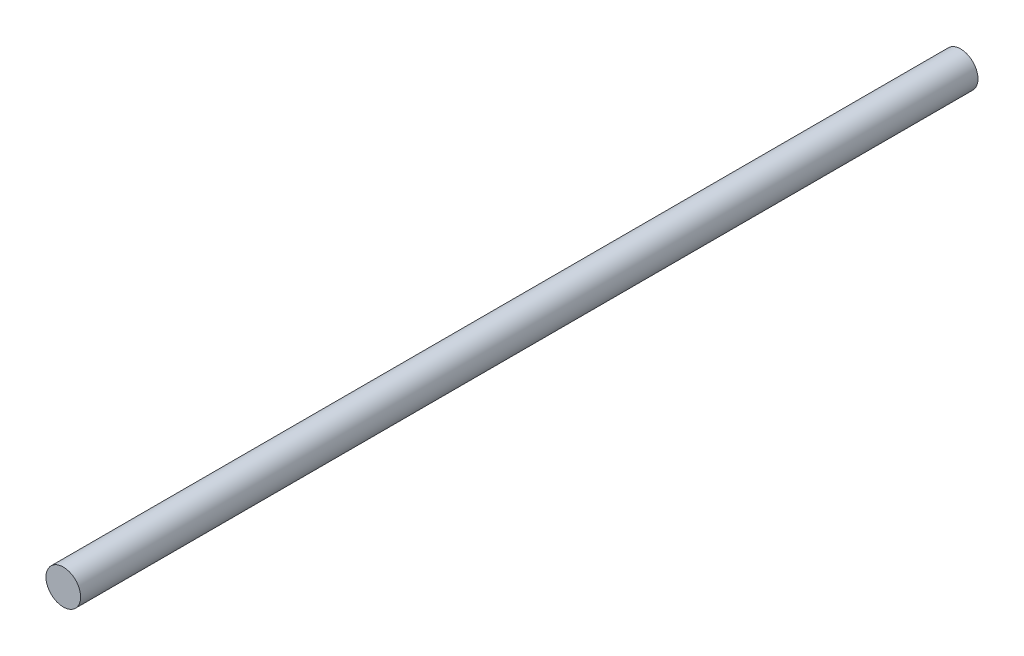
ISO-10303-21;
HEADER;
FILE_DESCRIPTION(('STEP AP214'),'2;1');
FILE_NAME('part.step','',(''),(''),'','','');
FILE_SCHEMA(('AUTOMOTIVE_DESIGN { 1 0 10303 214 1 1 1 1 }'));
ENDSEC;
DATA;
#1=APPLICATION_CONTEXT('core data for automotive mechanical design processes');
#2=APPLICATION_PROTOCOL_DEFINITION('international standard','automotive_design',2000,#1);
#3=PRODUCT_CONTEXT('',#1,'mechanical');
#4=PRODUCT('Part','Part','',(#3));
#5=PRODUCT_RELATED_PRODUCT_CATEGORY('part','',(#4));
#6=PRODUCT_DEFINITION_FORMATION('','',#4);
#7=PRODUCT_DEFINITION_CONTEXT('part definition',#1,'design');
#8=PRODUCT_DEFINITION('design','',#6,#7);
#9=PRODUCT_DEFINITION_SHAPE('','',#8);
#10=(LENGTH_UNIT() NAMED_UNIT(*) SI_UNIT(.MILLI.,.METRE.));
#11=(NAMED_UNIT(*) PLANE_ANGLE_UNIT() SI_UNIT($,.RADIAN.));
#12=(NAMED_UNIT(*) SI_UNIT($,.STERADIAN.) SOLID_ANGLE_UNIT());
#13=UNCERTAINTY_MEASURE_WITH_UNIT(LENGTH_MEASURE(1.E-05),#10,'distance_accuracy_value','');
#14=(GEOMETRIC_REPRESENTATION_CONTEXT(3) GLOBAL_UNCERTAINTY_ASSIGNED_CONTEXT((#13)) GLOBAL_UNIT_ASSIGNED_CONTEXT((#10,
#11,#12)) REPRESENTATION_CONTEXT('',''));
#15=CARTESIAN_POINT('',(0.,0.,0.));
#16=DIRECTION('',(0.,0.,1.));
#17=DIRECTION('',(1.,0.,0.));
#18=AXIS2_PLACEMENT_3D('',#15,#16,#17);
#19=CARTESIAN_POINT('',(0.,0.,414.3375));
#20=DIRECTION('',(0.,0.,-1.));
#21=DIRECTION('',(-1.,0.,0.));
#22=AXIS2_PLACEMENT_3D('',#19,#20,#21);
#23=CYLINDRICAL_SURFACE('',#22,8.001);
#24=CARTESIAN_POINT('',(0.,0.,414.3375));
#25=DIRECTION('',(0.,0.,1.));
#26=DIRECTION('',(1.,0.,0.));
#27=AXIS2_PLACEMENT_3D('',#24,#25,#26);
#28=CIRCLE('',#27,8.001);
#29=CARTESIAN_POINT('',(8.001,0.,414.3375));
#30=VERTEX_POINT('',#29);
#31=EDGE_CURVE('E10',#30,#30,#28,.T.);
#32=ORIENTED_EDGE('',*,*,#31,.F.);
#33=EDGE_LOOP('',(#32));
#34=FACE_BOUND('',#33,.T.);
#35=CARTESIAN_POINT('',(0.,0.,0.));
#36=DIRECTION('',(0.,0.,1.));
#37=DIRECTION('',(1.,0.,0.));
#38=AXIS2_PLACEMENT_3D('',#35,#36,#37);
#39=CIRCLE('',#38,8.001);
#40=CARTESIAN_POINT('',(8.001,0.,0.));
#41=VERTEX_POINT('',#40);
#42=EDGE_CURVE('E40',#41,#41,#39,.T.);
#43=ORIENTED_EDGE('',*,*,#42,.T.);
#44=EDGE_LOOP('',(#43));
#45=FACE_BOUND('',#44,.T.);
#46=ADVANCED_FACE('F37',(#34,#45),#23,.T.);
#47=CARTESIAN_POINT('',(0.,0.,414.3375));
#48=DIRECTION('',(0.,0.,1.));
#49=DIRECTION('',(1.,0.,0.));
#50=AXIS2_PLACEMENT_3D('',#47,#48,#49);
#51=PLANE('',#50);
#52=ORIENTED_EDGE('',*,*,#31,.T.);
#53=EDGE_LOOP('',(#52));
#54=FACE_BOUND('',#53,.T.);
#55=ADVANCED_FACE('F54',(#54),#51,.T.);
#56=CARTESIAN_POINT('',(0.,0.,0.));
#57=DIRECTION('',(0.,0.,1.));
#58=DIRECTION('',(1.,0.,0.));
#59=AXIS2_PLACEMENT_3D('',#56,#57,#58);
#60=PLANE('',#59);
#61=ORIENTED_EDGE('',*,*,#42,.F.);
#62=EDGE_LOOP('',(#61));
#63=FACE_BOUND('',#62,.T.);
#64=ADVANCED_FACE('F52',(#63),#60,.F.);
#65=CLOSED_SHELL('',(#46,#55,#64));
#66=MANIFOLD_SOLID_BREP('B2',#65);
#67=ADVANCED_BREP_SHAPE_REPRESENTATION('',(#18,#66),#14);
#68=SHAPE_DEFINITION_REPRESENTATION(#9,#67);
ENDSEC;
END-ISO-10303-21;
